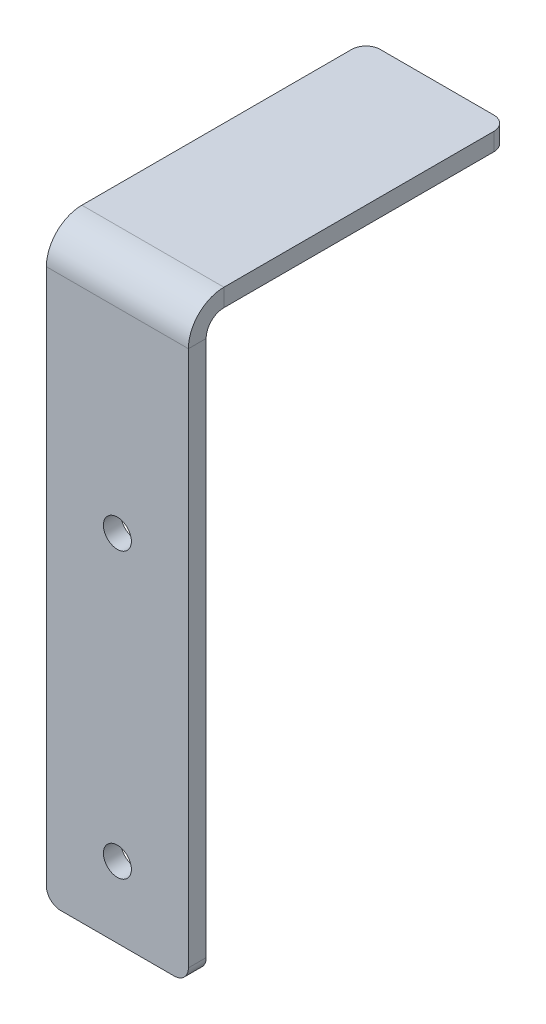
ISO-10303-21;
HEADER;
FILE_DESCRIPTION(('STEP AP214'),'2;1');
FILE_NAME('part.step','',(''),(''),'','','');
FILE_SCHEMA(('AUTOMOTIVE_DESIGN { 1 0 10303 214 1 1 1 1 }'));
ENDSEC;
DATA;
#1=APPLICATION_CONTEXT('core data for automotive mechanical design processes');
#2=APPLICATION_PROTOCOL_DEFINITION('international standard','automotive_design',2000,#1);
#3=PRODUCT_CONTEXT('',#1,'mechanical');
#4=PRODUCT('Part','Part','',(#3));
#5=PRODUCT_RELATED_PRODUCT_CATEGORY('part','',(#4));
#6=PRODUCT_DEFINITION_FORMATION('','',#4);
#7=PRODUCT_DEFINITION_CONTEXT('part definition',#1,'design');
#8=PRODUCT_DEFINITION('design','',#6,#7);
#9=PRODUCT_DEFINITION_SHAPE('','',#8);
#10=(LENGTH_UNIT() NAMED_UNIT(*) SI_UNIT(.MILLI.,.METRE.));
#11=(NAMED_UNIT(*) PLANE_ANGLE_UNIT() SI_UNIT($,.RADIAN.));
#12=(NAMED_UNIT(*) SI_UNIT($,.STERADIAN.) SOLID_ANGLE_UNIT());
#13=UNCERTAINTY_MEASURE_WITH_UNIT(LENGTH_MEASURE(1.E-05),#10,'distance_accuracy_value','');
#14=(GEOMETRIC_REPRESENTATION_CONTEXT(3) GLOBAL_UNCERTAINTY_ASSIGNED_CONTEXT((#13)) GLOBAL_UNIT_ASSIGNED_CONTEXT((#10,
#11,#12)) REPRESENTATION_CONTEXT('',''));
#15=CARTESIAN_POINT('',(0.,0.,0.));
#16=DIRECTION('',(0.,0.,1.));
#17=DIRECTION('',(1.,0.,0.));
#18=AXIS2_PLACEMENT_3D('',#15,#16,#17);
#19=CARTESIAN_POINT('',(11.6682781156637,27.7790891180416,-3.175));
#20=DIRECTION('',(1.,0.,0.));
#21=DIRECTION('',(0.,1.,0.));
#22=AXIS2_PLACEMENT_3D('',#19,#20,#21);
#23=PLANE('',#22);
#24=DIRECTION('',(0.,1.,0.));
#25=VECTOR('',#24,1.);
#26=CARTESIAN_POINT('',(11.6682781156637,27.7790891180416,0.));
#27=LINE('',#26,#25);
#28=CARTESIAN_POINT('',(11.6682781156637,-71.2809108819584,0.));
#29=VERTEX_POINT('',#28);
#30=CARTESIAN_POINT('',(11.6682781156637,24.6040891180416,0.));
#31=VERTEX_POINT('',#30);
#32=EDGE_CURVE('E185',#29,#31,#27,.T.);
#33=ORIENTED_EDGE('',*,*,#32,.F.);
#34=DIRECTION('',(0.,0.,1.));
#35=VECTOR('',#34,1.);
#36=CARTESIAN_POINT('',(11.6682781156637,-71.2809108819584,-3.175));
#37=LINE('',#36,#35);
#38=CARTESIAN_POINT('',(11.6682781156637,-71.2809108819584,-3.175));
#39=VERTEX_POINT('',#38);
#40=EDGE_CURVE('E212',#29,#39,#37,.F.);
#41=ORIENTED_EDGE('',*,*,#40,.T.);
#42=DIRECTION('',(0.,1.,0.));
#43=VECTOR('',#42,1.);
#44=CARTESIAN_POINT('',(11.6682781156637,27.7790891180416,-3.175));
#45=LINE('',#44,#43);
#46=CARTESIAN_POINT('',(11.6682781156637,24.6040891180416,-3.175));
#47=VERTEX_POINT('',#46);
#48=EDGE_CURVE('E188',#39,#47,#45,.T.);
#49=ORIENTED_EDGE('',*,*,#48,.T.);
#50=DIRECTION('',(0.,0.,1.));
#51=VECTOR('',#50,1.);
#52=CARTESIAN_POINT('',(11.6682781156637,24.6040891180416,-3.175));
#53=LINE('',#52,#51);
#54=EDGE_CURVE('E169',#47,#31,#53,.T.);
#55=ORIENTED_EDGE('',*,*,#54,.T.);
#56=EDGE_LOOP('',(#33,#41,#49,#55));
#57=FACE_BOUND('',#56,.T.);
#58=ADVANCED_FACE('F33',(#57),#23,.T.);
#59=CARTESIAN_POINT('',(-13.7317218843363,-73.8209108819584,-3.175));
#60=DIRECTION('',(0.,0.,1.));
#61=DIRECTION('',(1.,0.,0.));
#62=AXIS2_PLACEMENT_3D('',#59,#60,#61);
#63=PLANE('',#62);
#64=CARTESIAN_POINT('',(-1.03172188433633,-10.3209108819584,-3.175));
#65=DIRECTION('',(0.,0.,1.));
#66=DIRECTION('',(1.,0.,0.));
#67=AXIS2_PLACEMENT_3D('',#64,#65,#66);
#68=CIRCLE('',#67,2.5019);
#69=CARTESIAN_POINT('',(1.47017811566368,-10.3209108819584,-3.175));
#70=VERTEX_POINT('',#69);
#71=EDGE_CURVE('E252',#70,#70,#68,.T.);
#72=ORIENTED_EDGE('',*,*,#71,.T.);
#73=EDGE_LOOP('',(#72));
#74=FACE_BOUND('',#73,.T.);
#75=CARTESIAN_POINT('',(-1.03172188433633,-61.1209108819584,-3.175));
#76=DIRECTION('',(0.,0.,1.));
#77=DIRECTION('',(1.,0.,0.));
#78=AXIS2_PLACEMENT_3D('',#75,#76,#77);
#79=CIRCLE('',#78,2.5);
#80=CARTESIAN_POINT('',(1.46827811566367,-61.1209108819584,-3.175));
#81=VERTEX_POINT('',#80);
#82=EDGE_CURVE('E245',#81,#81,#79,.T.);
#83=ORIENTED_EDGE('',*,*,#82,.T.);
#84=EDGE_LOOP('',(#83));
#85=FACE_BOUND('',#84,.T.);
#86=DIRECTION('',(1.,0.,0.));
#87=VECTOR('',#86,1.);
#88=CARTESIAN_POINT('',(-13.7317218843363,-73.8209108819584,-3.175));
#89=LINE('',#88,#87);
#90=CARTESIAN_POINT('',(-11.1917218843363,-73.8209108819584,-3.175));
#91=VERTEX_POINT('',#90);
#92=CARTESIAN_POINT('',(9.12827811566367,-73.8209108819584,-3.175));
#93=VERTEX_POINT('',#92);
#94=EDGE_CURVE('E184',#91,#93,#89,.T.);
#95=ORIENTED_EDGE('',*,*,#94,.F.);
#96=CARTESIAN_POINT('',(-11.1917218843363,-71.2809108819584,-3.175));
#97=DIRECTION('',(0.,0.,1.));
#98=DIRECTION('',(1.,0.,0.));
#99=AXIS2_PLACEMENT_3D('',#96,#97,#98);
#100=CIRCLE('',#99,2.54);
#101=CARTESIAN_POINT('',(-13.7317218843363,-71.2809108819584,-3.175));
#102=VERTEX_POINT('',#101);
#103=EDGE_CURVE('E210',#91,#102,#100,.F.);
#104=ORIENTED_EDGE('',*,*,#103,.T.);
#105=DIRECTION('',(0.,-1.,0.));
#106=VECTOR('',#105,1.);
#107=CARTESIAN_POINT('',(-13.7317218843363,27.7790891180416,-3.175));
#108=LINE('',#107,#106);
#109=CARTESIAN_POINT('',(-13.7317218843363,24.6040891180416,-3.175));
#110=VERTEX_POINT('',#109);
#111=EDGE_CURVE('E181',#110,#102,#108,.T.);
#112=ORIENTED_EDGE('',*,*,#111,.F.);
#113=DIRECTION('',(1.,0.,0.));
#114=VECTOR('',#113,1.);
#115=CARTESIAN_POINT('',(11.6682781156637,24.6040891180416,-3.175));
#116=LINE('',#115,#114);
#117=EDGE_CURVE('E173',#47,#110,#116,.F.);
#118=ORIENTED_EDGE('',*,*,#117,.F.);
#119=ORIENTED_EDGE('',*,*,#48,.F.);
#120=CARTESIAN_POINT('',(9.12827811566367,-71.2809108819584,-3.175));
#121=DIRECTION('',(0.,0.,1.));
#122=DIRECTION('',(1.,0.,0.));
#123=AXIS2_PLACEMENT_3D('',#120,#121,#122);
#124=CIRCLE('',#123,2.54);
#125=EDGE_CURVE('E208',#39,#93,#124,.F.);
#126=ORIENTED_EDGE('',*,*,#125,.T.);
#127=EDGE_LOOP('',(#95,#104,#112,#118,#119,#126));
#128=FACE_BOUND('',#127,.T.);
#129=ADVANCED_FACE('F266',(#74,#85,#128),#63,.F.);
#130=CARTESIAN_POINT('',(-13.7317218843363,-73.8209108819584,0.));
#131=DIRECTION('',(0.,0.,1.));
#132=DIRECTION('',(1.,0.,0.));
#133=AXIS2_PLACEMENT_3D('',#130,#131,#132);
#134=PLANE('',#133);
#135=CARTESIAN_POINT('',(-1.03172188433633,-10.3209108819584,0.));
#136=DIRECTION('',(0.,0.,1.));
#137=DIRECTION('',(1.,0.,0.));
#138=AXIS2_PLACEMENT_3D('',#135,#136,#137);
#139=CIRCLE('',#138,2.5019);
#140=CARTESIAN_POINT('',(1.47017811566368,-10.3209108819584,0.));
#141=VERTEX_POINT('',#140);
#142=EDGE_CURVE('E255',#141,#141,#139,.T.);
#143=ORIENTED_EDGE('',*,*,#142,.F.);
#144=EDGE_LOOP('',(#143));
#145=FACE_BOUND('',#144,.T.);
#146=CARTESIAN_POINT('',(-1.03172188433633,-61.1209108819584,0.));
#147=DIRECTION('',(0.,0.,1.));
#148=DIRECTION('',(1.,0.,0.));
#149=AXIS2_PLACEMENT_3D('',#146,#147,#148);
#150=CIRCLE('',#149,2.5);
#151=CARTESIAN_POINT('',(1.46827811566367,-61.1209108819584,0.));
#152=VERTEX_POINT('',#151);
#153=EDGE_CURVE('E249',#152,#152,#150,.T.);
#154=ORIENTED_EDGE('',*,*,#153,.F.);
#155=EDGE_LOOP('',(#154));
#156=FACE_BOUND('',#155,.T.);
#157=DIRECTION('',(0.,-1.,0.));
#158=VECTOR('',#157,1.);
#159=CARTESIAN_POINT('',(-13.7317218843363,27.7790891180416,0.));
#160=LINE('',#159,#158);
#161=CARTESIAN_POINT('',(-13.7317218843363,24.6040891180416,0.));
#162=VERTEX_POINT('',#161);
#163=CARTESIAN_POINT('',(-13.7317218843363,-71.2809108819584,0.));
#164=VERTEX_POINT('',#163);
#165=EDGE_CURVE('E179',#162,#164,#160,.T.);
#166=ORIENTED_EDGE('',*,*,#165,.T.);
#167=CARTESIAN_POINT('',(-11.1917218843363,-71.2809108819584,0.));
#168=DIRECTION('',(0.,0.,1.));
#169=DIRECTION('',(1.,0.,0.));
#170=AXIS2_PLACEMENT_3D('',#167,#168,#169);
#171=CIRCLE('',#170,2.54);
#172=CARTESIAN_POINT('',(-11.1917218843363,-73.8209108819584,0.));
#173=VERTEX_POINT('',#172);
#174=EDGE_CURVE('E201',#164,#173,#171,.T.);
#175=ORIENTED_EDGE('',*,*,#174,.T.);
#176=DIRECTION('',(1.,0.,0.));
#177=VECTOR('',#176,1.);
#178=CARTESIAN_POINT('',(-13.7317218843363,-73.8209108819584,0.));
#179=LINE('',#178,#177);
#180=CARTESIAN_POINT('',(9.12827811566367,-73.8209108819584,0.));
#181=VERTEX_POINT('',#180);
#182=EDGE_CURVE('E193',#173,#181,#179,.T.);
#183=ORIENTED_EDGE('',*,*,#182,.T.);
#184=CARTESIAN_POINT('',(9.12827811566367,-71.2809108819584,0.));
#185=DIRECTION('',(0.,0.,1.));
#186=DIRECTION('',(1.,0.,0.));
#187=AXIS2_PLACEMENT_3D('',#184,#185,#186);
#188=CIRCLE('',#187,2.54);
#189=EDGE_CURVE('E199',#181,#29,#188,.T.);
#190=ORIENTED_EDGE('',*,*,#189,.T.);
#191=ORIENTED_EDGE('',*,*,#32,.T.);
#192=DIRECTION('',(1.,0.,0.));
#193=VECTOR('',#192,1.);
#194=CARTESIAN_POINT('',(11.6682781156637,24.6040891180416,0.));
#195=LINE('',#194,#193);
#196=EDGE_CURVE('E132',#31,#162,#195,.F.);
#197=ORIENTED_EDGE('',*,*,#196,.T.);
#198=EDGE_LOOP('',(#166,#175,#183,#190,#191,#197));
#199=FACE_BOUND('',#198,.T.);
#200=ADVANCED_FACE('F262',(#145,#156,#199),#134,.T.);
#201=CARTESIAN_POINT('',(-13.7317218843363,27.7790891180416,-3.175));
#202=DIRECTION('',(-1.,0.,0.));
#203=DIRECTION('',(0.,-1.,0.));
#204=AXIS2_PLACEMENT_3D('',#201,#202,#203);
#205=PLANE('',#204);
#206=ORIENTED_EDGE('',*,*,#111,.T.);
#207=DIRECTION('',(0.,0.,1.));
#208=VECTOR('',#207,1.);
#209=CARTESIAN_POINT('',(-13.7317218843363,-71.2809108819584,-3.175));
#210=LINE('',#209,#208);
#211=EDGE_CURVE('E190',#102,#164,#210,.T.);
#212=ORIENTED_EDGE('',*,*,#211,.T.);
#213=ORIENTED_EDGE('',*,*,#165,.F.);
#214=DIRECTION('',(0.,0.,1.));
#215=VECTOR('',#214,1.);
#216=CARTESIAN_POINT('',(-13.7317218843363,24.6040891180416,-3.175));
#217=LINE('',#216,#215);
#218=EDGE_CURVE('E176',#110,#162,#217,.T.);
#219=ORIENTED_EDGE('',*,*,#218,.F.);
#220=EDGE_LOOP('',(#206,#212,#213,#219));
#221=FACE_BOUND('',#220,.T.);
#222=ADVANCED_FACE('F265',(#221),#205,.T.);
#223=CARTESIAN_POINT('',(-13.7317218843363,-73.8209108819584,-3.175));
#224=DIRECTION('',(0.,-1.,0.));
#225=DIRECTION('',(0.,0.,-1.));
#226=AXIS2_PLACEMENT_3D('',#223,#224,#225);
#227=PLANE('',#226);
#228=ORIENTED_EDGE('',*,*,#182,.F.);
#229=DIRECTION('',(0.,0.,1.));
#230=VECTOR('',#229,1.);
#231=CARTESIAN_POINT('',(-11.1917218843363,-73.8209108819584,-3.175));
#232=LINE('',#231,#230);
#233=EDGE_CURVE('E206',#173,#91,#232,.F.);
#234=ORIENTED_EDGE('',*,*,#233,.T.);
#235=ORIENTED_EDGE('',*,*,#94,.T.);
#236=DIRECTION('',(0.,0.,1.));
#237=VECTOR('',#236,1.);
#238=CARTESIAN_POINT('',(9.12827811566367,-73.8209108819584,-3.175));
#239=LINE('',#238,#237);
#240=EDGE_CURVE('E203',#93,#181,#239,.T.);
#241=ORIENTED_EDGE('',*,*,#240,.T.);
#242=EDGE_LOOP('',(#228,#234,#235,#241));
#243=FACE_BOUND('',#242,.T.);
#244=ADVANCED_FACE('F282',(#243),#227,.T.);
#245=CARTESIAN_POINT('',(-13.7317218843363,24.6040891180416,-6.35));
#246=DIRECTION('',(-1.,0.,0.));
#247=DIRECTION('',(0.,0.,1.));
#248=AXIS2_PLACEMENT_3D('',#245,#246,#247);
#249=PLANE('',#248);
#250=DIRECTION('',(0.,1.,0.));
#251=VECTOR('',#250,1.);
#252=CARTESIAN_POINT('',(-13.7317218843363,27.7790891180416,-6.34999999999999));
#253=LINE('',#252,#251);
#254=CARTESIAN_POINT('',(-13.7317218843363,27.7790891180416,-6.34999999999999));
#255=VERTEX_POINT('',#254);
#256=CARTESIAN_POINT('',(-13.7317218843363,30.9540891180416,-6.34999999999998));
#257=VERTEX_POINT('',#256);
#258=EDGE_CURVE('E234',#255,#257,#253,.T.);
#259=ORIENTED_EDGE('',*,*,#258,.F.);
#260=CARTESIAN_POINT('',(-13.7317218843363,24.6040891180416,-6.35));
#261=DIRECTION('',(1.,0.,0.));
#262=DIRECTION('',(0.,0.,-1.));
#263=AXIS2_PLACEMENT_3D('',#260,#261,#262);
#264=CIRCLE('',#263,3.175);
#265=EDGE_CURVE('E136',#110,#255,#264,.F.);
#266=ORIENTED_EDGE('',*,*,#265,.F.);
#267=ORIENTED_EDGE('',*,*,#218,.T.);
#268=CARTESIAN_POINT('',(-13.7317218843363,24.6040891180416,-6.35));
#269=DIRECTION('',(1.,0.,0.));
#270=DIRECTION('',(0.,0.,-1.));
#271=AXIS2_PLACEMENT_3D('',#268,#269,#270);
#272=CIRCLE('',#271,6.35);
#273=EDGE_CURVE('E168',#162,#257,#272,.F.);
#274=ORIENTED_EDGE('',*,*,#273,.T.);
#275=EDGE_LOOP('',(#259,#266,#267,#274));
#276=FACE_BOUND('',#275,.T.);
#277=ADVANCED_FACE('F296',(#276),#249,.T.);
#278=CARTESIAN_POINT('',(11.6682781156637,24.6040891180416,-6.35));
#279=DIRECTION('',(-1.,0.,0.));
#280=DIRECTION('',(0.,0.,1.));
#281=AXIS2_PLACEMENT_3D('',#278,#279,#280);
#282=PLANE('',#281);
#283=CARTESIAN_POINT('',(11.6682781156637,24.6040891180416,-6.35));
#284=DIRECTION('',(1.,0.,0.));
#285=DIRECTION('',(0.,0.,-1.));
#286=AXIS2_PLACEMENT_3D('',#283,#284,#285);
#287=CIRCLE('',#286,3.175);
#288=CARTESIAN_POINT('',(11.6682781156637,27.7790891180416,-6.34999999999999));
#289=VERTEX_POINT('',#288);
#290=EDGE_CURVE('E143',#289,#47,#287,.T.);
#291=ORIENTED_EDGE('',*,*,#290,.F.);
#292=DIRECTION('',(0.,1.,0.));
#293=VECTOR('',#292,1.);
#294=CARTESIAN_POINT('',(11.6682781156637,27.7790891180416,-6.34999999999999));
#295=LINE('',#294,#293);
#296=CARTESIAN_POINT('',(11.6682781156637,30.9540891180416,-6.34999999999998));
#297=VERTEX_POINT('',#296);
#298=EDGE_CURVE('E140',#289,#297,#295,.T.);
#299=ORIENTED_EDGE('',*,*,#298,.T.);
#300=CARTESIAN_POINT('',(11.6682781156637,24.6040891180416,-6.35));
#301=DIRECTION('',(1.,0.,0.));
#302=DIRECTION('',(0.,0.,-1.));
#303=AXIS2_PLACEMENT_3D('',#300,#301,#302);
#304=CIRCLE('',#303,6.35);
#305=EDGE_CURVE('E125',#297,#31,#304,.T.);
#306=ORIENTED_EDGE('',*,*,#305,.T.);
#307=ORIENTED_EDGE('',*,*,#54,.F.);
#308=EDGE_LOOP('',(#291,#299,#306,#307));
#309=FACE_BOUND('',#308,.T.);
#310=ADVANCED_FACE('F141',(#309),#282,.F.);
#311=CARTESIAN_POINT('',(11.6682781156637,24.6040891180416,-6.35));
#312=DIRECTION('',(1.,0.,0.));
#313=DIRECTION('',(0.,1.,0.));
#314=AXIS2_PLACEMENT_3D('',#311,#312,#313);
#315=CYLINDRICAL_SURFACE('',#314,6.35);
#316=ORIENTED_EDGE('',*,*,#196,.F.);
#317=ORIENTED_EDGE('',*,*,#305,.F.);
#318=DIRECTION('',(-1.,0.,0.));
#319=VECTOR('',#318,1.);
#320=CARTESIAN_POINT('',(11.6682781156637,30.9540891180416,-6.34999999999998));
#321=LINE('',#320,#319);
#322=EDGE_CURVE('E129',#297,#257,#321,.T.);
#323=ORIENTED_EDGE('',*,*,#322,.T.);
#324=ORIENTED_EDGE('',*,*,#273,.F.);
#325=EDGE_LOOP('',(#316,#317,#323,#324));
#326=FACE_BOUND('',#325,.T.);
#327=ADVANCED_FACE('F127',(#326),#315,.T.);
#328=CARTESIAN_POINT('',(11.6682781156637,24.6040891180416,-6.35));
#329=DIRECTION('',(1.,0.,0.));
#330=DIRECTION('',(0.,1.,0.));
#331=AXIS2_PLACEMENT_3D('',#328,#329,#330);
#332=CYLINDRICAL_SURFACE('',#331,3.175);
#333=ORIENTED_EDGE('',*,*,#117,.T.);
#334=ORIENTED_EDGE('',*,*,#265,.T.);
#335=DIRECTION('',(1.,0.,0.));
#336=VECTOR('',#335,1.);
#337=CARTESIAN_POINT('',(-13.7317218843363,27.7790891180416,-6.34999999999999));
#338=LINE('',#337,#336);
#339=EDGE_CURVE('E145',#255,#289,#338,.T.);
#340=ORIENTED_EDGE('',*,*,#339,.T.);
#341=ORIENTED_EDGE('',*,*,#290,.T.);
#342=EDGE_LOOP('',(#333,#334,#340,#341));
#343=FACE_BOUND('',#342,.T.);
#344=ADVANCED_FACE('F293',(#343),#332,.F.);
#345=CARTESIAN_POINT('',(11.6682781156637,30.9540891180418,-57.15));
#346=DIRECTION('',(-1.,0.,0.));
#347=DIRECTION('',(0.,0.,1.));
#348=AXIS2_PLACEMENT_3D('',#345,#346,#347);
#349=PLANE('',#348);
#350=DIRECTION('',(0.,0.,-1.));
#351=VECTOR('',#350,1.);
#352=CARTESIAN_POINT('',(11.6682781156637,27.7790891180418,-57.15));
#353=LINE('',#352,#351);
#354=CARTESIAN_POINT('',(11.6682781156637,27.7790891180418,-54.61));
#355=VERTEX_POINT('',#354);
#356=EDGE_CURVE('E153',#289,#355,#353,.T.);
#357=ORIENTED_EDGE('',*,*,#356,.T.);
#358=DIRECTION('',(0.,-1.,0.));
#359=VECTOR('',#358,1.);
#360=CARTESIAN_POINT('',(11.6682781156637,30.9540891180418,-54.61));
#361=LINE('',#360,#359);
#362=CARTESIAN_POINT('',(11.6682781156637,30.9540891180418,-54.61));
#363=VERTEX_POINT('',#362);
#364=EDGE_CURVE('E11',#355,#363,#361,.F.);
#365=ORIENTED_EDGE('',*,*,#364,.T.);
#366=DIRECTION('',(0.,0.,-1.));
#367=VECTOR('',#366,1.);
#368=CARTESIAN_POINT('',(11.6682781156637,30.9540891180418,-57.15));
#369=LINE('',#368,#367);
#370=EDGE_CURVE('E149',#297,#363,#369,.T.);
#371=ORIENTED_EDGE('',*,*,#370,.F.);
#372=ORIENTED_EDGE('',*,*,#298,.F.);
#373=EDGE_LOOP('',(#357,#365,#371,#372));
#374=FACE_BOUND('',#373,.T.);
#375=ADVANCED_FACE('F155',(#374),#349,.F.);
#376=CARTESIAN_POINT('',(-13.7317218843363,30.9540891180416,-3.17499999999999));
#377=DIRECTION('',(1.,0.,0.));
#378=DIRECTION('',(0.,0.,-1.));
#379=AXIS2_PLACEMENT_3D('',#376,#377,#378);
#380=PLANE('',#379);
#381=DIRECTION('',(0.,0.,1.));
#382=VECTOR('',#381,1.);
#383=CARTESIAN_POINT('',(-13.7317218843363,30.9540891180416,-3.17499999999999));
#384=LINE('',#383,#382);
#385=CARTESIAN_POINT('',(-13.7317218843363,30.9540891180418,-54.61));
#386=VERTEX_POINT('',#385);
#387=EDGE_CURVE('E152',#386,#257,#384,.T.);
#388=ORIENTED_EDGE('',*,*,#387,.F.);
#389=DIRECTION('',(0.,-1.,0.));
#390=VECTOR('',#389,1.);
#391=CARTESIAN_POINT('',(-13.7317218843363,30.9540891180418,-54.61));
#392=LINE('',#391,#390);
#393=CARTESIAN_POINT('',(-13.7317218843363,27.7790891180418,-54.61));
#394=VERTEX_POINT('',#393);
#395=EDGE_CURVE('E214',#386,#394,#392,.T.);
#396=ORIENTED_EDGE('',*,*,#395,.T.);
#397=DIRECTION('',(0.,0.,1.));
#398=VECTOR('',#397,1.);
#399=CARTESIAN_POINT('',(-13.7317218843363,27.7790891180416,-3.175));
#400=LINE('',#399,#398);
#401=EDGE_CURVE('E157',#394,#255,#400,.T.);
#402=ORIENTED_EDGE('',*,*,#401,.T.);
#403=ORIENTED_EDGE('',*,*,#258,.T.);
#404=EDGE_LOOP('',(#388,#396,#402,#403));
#405=FACE_BOUND('',#404,.T.);
#406=ADVANCED_FACE('F231',(#405),#380,.F.);
#407=CARTESIAN_POINT('',(11.6682781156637,30.9540891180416,-3.17499999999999));
#408=DIRECTION('',(0.,-1.,0.));
#409=DIRECTION('',(0.,0.,-1.));
#410=AXIS2_PLACEMENT_3D('',#407,#408,#409);
#411=PLANE('',#410);
#412=DIRECTION('',(-1.,0.,0.));
#413=VECTOR('',#412,1.);
#414=CARTESIAN_POINT('',(-13.7317218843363,30.9540891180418,-57.15));
#415=LINE('',#414,#413);
#416=CARTESIAN_POINT('',(9.12827811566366,30.9540891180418,-57.15));
#417=VERTEX_POINT('',#416);
#418=CARTESIAN_POINT('',(-11.1917218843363,30.9540891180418,-57.15));
#419=VERTEX_POINT('',#418);
#420=EDGE_CURVE('E156',#417,#419,#415,.T.);
#421=ORIENTED_EDGE('',*,*,#420,.T.);
#422=CARTESIAN_POINT('',(-11.1917218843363,30.9540891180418,-54.61));
#423=DIRECTION('',(0.,-1.,0.));
#424=DIRECTION('',(0.,0.,-1.));
#425=AXIS2_PLACEMENT_3D('',#422,#423,#424);
#426=CIRCLE('',#425,2.54);
#427=EDGE_CURVE('E41',#419,#386,#426,.F.);
#428=ORIENTED_EDGE('',*,*,#427,.T.);
#429=ORIENTED_EDGE('',*,*,#387,.T.);
#430=ORIENTED_EDGE('',*,*,#322,.F.);
#431=ORIENTED_EDGE('',*,*,#370,.T.);
#432=CARTESIAN_POINT('',(9.12827811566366,30.9540891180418,-54.61));
#433=DIRECTION('',(0.,-1.,0.));
#434=DIRECTION('',(0.,0.,-1.));
#435=AXIS2_PLACEMENT_3D('',#432,#433,#434);
#436=CIRCLE('',#435,2.54);
#437=EDGE_CURVE('E225',#363,#417,#436,.F.);
#438=ORIENTED_EDGE('',*,*,#437,.T.);
#439=EDGE_LOOP('',(#421,#428,#429,#430,#431,#438));
#440=FACE_BOUND('',#439,.T.);
#441=ADVANCED_FACE('F148',(#440),#411,.F.);
#442=CARTESIAN_POINT('',(11.6682781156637,27.7790891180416,-3.175));
#443=DIRECTION('',(0.,-1.,0.));
#444=DIRECTION('',(0.,0.,-1.));
#445=AXIS2_PLACEMENT_3D('',#442,#443,#444);
#446=PLANE('',#445);
#447=ORIENTED_EDGE('',*,*,#401,.F.);
#448=CARTESIAN_POINT('',(-11.1917218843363,27.7790891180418,-54.61));
#449=DIRECTION('',(0.,-1.,0.));
#450=DIRECTION('',(0.,0.,-1.));
#451=AXIS2_PLACEMENT_3D('',#448,#449,#450);
#452=CIRCLE('',#451,2.54);
#453=CARTESIAN_POINT('',(-11.1917218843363,27.7790891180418,-57.15));
#454=VERTEX_POINT('',#453);
#455=EDGE_CURVE('E219',#394,#454,#452,.T.);
#456=ORIENTED_EDGE('',*,*,#455,.T.);
#457=DIRECTION('',(-1.,0.,0.));
#458=VECTOR('',#457,1.);
#459=CARTESIAN_POINT('',(-13.7317218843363,27.7790891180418,-57.15));
#460=LINE('',#459,#458);
#461=CARTESIAN_POINT('',(9.12827811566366,27.7790891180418,-57.15));
#462=VERTEX_POINT('',#461);
#463=EDGE_CURVE('E160',#462,#454,#460,.T.);
#464=ORIENTED_EDGE('',*,*,#463,.F.);
#465=CARTESIAN_POINT('',(9.12827811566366,27.7790891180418,-54.61));
#466=DIRECTION('',(0.,-1.,0.));
#467=DIRECTION('',(0.,0.,-1.));
#468=AXIS2_PLACEMENT_3D('',#465,#466,#467);
#469=CIRCLE('',#468,2.54);
#470=EDGE_CURVE('E217',#462,#355,#469,.T.);
#471=ORIENTED_EDGE('',*,*,#470,.T.);
#472=ORIENTED_EDGE('',*,*,#356,.F.);
#473=ORIENTED_EDGE('',*,*,#339,.F.);
#474=EDGE_LOOP('',(#447,#456,#464,#471,#472,#473));
#475=FACE_BOUND('',#474,.T.);
#476=ADVANCED_FACE('F238',(#475),#446,.T.);
#477=CARTESIAN_POINT('',(-13.7317218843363,30.9540891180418,-57.15));
#478=DIRECTION('',(0.,0.,1.));
#479=DIRECTION('',(0.,-1.,0.));
#480=AXIS2_PLACEMENT_3D('',#477,#478,#479);
#481=PLANE('',#480);
#482=ORIENTED_EDGE('',*,*,#463,.T.);
#483=DIRECTION('',(0.,-1.,0.));
#484=VECTOR('',#483,1.);
#485=CARTESIAN_POINT('',(-11.1917218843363,30.9540891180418,-57.15));
#486=LINE('',#485,#484);
#487=EDGE_CURVE('E54',#454,#419,#486,.F.);
#488=ORIENTED_EDGE('',*,*,#487,.T.);
#489=ORIENTED_EDGE('',*,*,#420,.F.);
#490=DIRECTION('',(0.,-1.,0.));
#491=VECTOR('',#490,1.);
#492=CARTESIAN_POINT('',(9.12827811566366,30.9540891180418,-57.15));
#493=LINE('',#492,#491);
#494=EDGE_CURVE('E221',#417,#462,#493,.T.);
#495=ORIENTED_EDGE('',*,*,#494,.T.);
#496=EDGE_LOOP('',(#482,#488,#489,#495));
#497=FACE_BOUND('',#496,.T.);
#498=ADVANCED_FACE('F240',(#497),#481,.F.);
#499=CARTESIAN_POINT('',(-1.03172188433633,-61.1209108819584,-57.15));
#500=DIRECTION('',(0.,0.,1.));
#501=DIRECTION('',(1.,0.,0.));
#502=AXIS2_PLACEMENT_3D('',#499,#500,#501);
#503=CYLINDRICAL_SURFACE('',#502,2.5);
#504=CARTESIAN_POINT('',(1.46827811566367,-61.1209108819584,0.));
#505=CARTESIAN_POINT('',(1.46827811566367,-61.1209108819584,-0.0330729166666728));
#506=CARTESIAN_POINT('',(1.46827811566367,-61.1209108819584,-0.0661458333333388));
#507=CARTESIAN_POINT('',(1.46827811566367,-61.1209108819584,-0.132291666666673));
#508=CARTESIAN_POINT('',(1.46827811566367,-61.1209108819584,-0.165364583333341));
#509=CARTESIAN_POINT('',(1.46827811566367,-61.1209108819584,-0.231510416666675));
#510=CARTESIAN_POINT('',(1.46827811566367,-61.1209108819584,-0.264583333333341));
#511=CARTESIAN_POINT('',(1.46827811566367,-61.1209108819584,-0.330729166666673));
#512=CARTESIAN_POINT('',(1.46827811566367,-61.1209108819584,-0.363802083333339));
#513=CARTESIAN_POINT('',(1.46827811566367,-61.1209108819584,-0.429947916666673));
#514=CARTESIAN_POINT('',(1.46827811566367,-61.1209108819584,-0.463020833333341));
#515=CARTESIAN_POINT('',(1.46827811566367,-61.1209108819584,-0.529166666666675));
#516=CARTESIAN_POINT('',(1.46827811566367,-61.1209108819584,-0.562239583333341));
#517=CARTESIAN_POINT('',(1.46827811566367,-61.1209108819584,-0.628385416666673));
#518=CARTESIAN_POINT('',(1.46827811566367,-61.1209108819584,-0.661458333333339));
#519=CARTESIAN_POINT('',(1.46827811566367,-61.1209108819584,-0.727604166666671));
#520=CARTESIAN_POINT('',(1.46827811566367,-61.1209108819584,-0.760677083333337));
#521=CARTESIAN_POINT('',(1.46827811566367,-61.1209108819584,-0.826822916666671));
#522=CARTESIAN_POINT('',(1.46827811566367,-61.1209108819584,-0.859895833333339));
#523=CARTESIAN_POINT('',(1.46827811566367,-61.1209108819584,-0.926041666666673));
#524=CARTESIAN_POINT('',(1.46827811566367,-61.1209108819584,-0.959114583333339));
#525=CARTESIAN_POINT('',(1.46827811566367,-61.1209108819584,-1.02526041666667));
#526=CARTESIAN_POINT('',(1.46827811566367,-61.1209108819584,-1.05833333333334));
#527=CARTESIAN_POINT('',(1.46827811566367,-61.1209108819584,-1.12447916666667));
#528=CARTESIAN_POINT('',(1.46827811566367,-61.1209108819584,-1.15755208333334));
#529=CARTESIAN_POINT('',(1.46827811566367,-61.1209108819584,-1.22369791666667));
#530=CARTESIAN_POINT('',(1.46827811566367,-61.1209108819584,-1.25677083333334));
#531=CARTESIAN_POINT('',(1.46827811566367,-61.1209108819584,-1.32291666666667));
#532=CARTESIAN_POINT('',(1.46827811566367,-61.1209108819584,-1.35598958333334));
#533=CARTESIAN_POINT('',(1.46827811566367,-61.1209108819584,-1.42213541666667));
#534=CARTESIAN_POINT('',(1.46827811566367,-61.1209108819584,-1.45520833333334));
#535=CARTESIAN_POINT('',(1.46827811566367,-61.1209108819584,-1.52135416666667));
#536=CARTESIAN_POINT('',(1.46827811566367,-61.1209108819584,-1.55442708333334));
#537=CARTESIAN_POINT('',(1.46827811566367,-61.1209108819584,-1.62057291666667));
#538=CARTESIAN_POINT('',(1.46827811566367,-61.1209108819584,-1.65364583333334));
#539=CARTESIAN_POINT('',(1.46827811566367,-61.1209108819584,-1.71979166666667));
#540=CARTESIAN_POINT('',(1.46827811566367,-61.1209108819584,-1.75286458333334));
#541=CARTESIAN_POINT('',(1.46827811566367,-61.1209108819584,-1.81901041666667));
#542=CARTESIAN_POINT('',(1.46827811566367,-61.1209108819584,-1.85208333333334));
#543=CARTESIAN_POINT('',(1.46827811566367,-61.1209108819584,-1.91822916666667));
#544=CARTESIAN_POINT('',(1.46827811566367,-61.1209108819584,-1.95130208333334));
#545=CARTESIAN_POINT('',(1.46827811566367,-61.1209108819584,-2.01744791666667));
#546=CARTESIAN_POINT('',(1.46827811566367,-61.1209108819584,-2.05052083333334));
#547=CARTESIAN_POINT('',(1.46827811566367,-61.1209108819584,-2.11666666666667));
#548=CARTESIAN_POINT('',(1.46827811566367,-61.1209108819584,-2.14973958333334));
#549=CARTESIAN_POINT('',(1.46827811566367,-61.1209108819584,-2.21588541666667));
#550=CARTESIAN_POINT('',(1.46827811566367,-61.1209108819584,-2.24895833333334));
#551=CARTESIAN_POINT('',(1.46827811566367,-61.1209108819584,-2.31510416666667));
#552=CARTESIAN_POINT('',(1.46827811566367,-61.1209108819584,-2.34817708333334));
#553=CARTESIAN_POINT('',(1.46827811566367,-61.1209108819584,-2.41432291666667));
#554=CARTESIAN_POINT('',(1.46827811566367,-61.1209108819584,-2.44739583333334));
#555=CARTESIAN_POINT('',(1.46827811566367,-61.1209108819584,-2.51354166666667));
#556=CARTESIAN_POINT('',(1.46827811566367,-61.1209108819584,-2.54661458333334));
#557=CARTESIAN_POINT('',(1.46827811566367,-61.1209108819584,-2.61276041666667));
#558=CARTESIAN_POINT('',(1.46827811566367,-61.1209108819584,-2.64583333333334));
#559=CARTESIAN_POINT('',(1.46827811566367,-61.1209108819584,-2.71197916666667));
#560=CARTESIAN_POINT('',(1.46827811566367,-61.1209108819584,-2.74505208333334));
#561=CARTESIAN_POINT('',(1.46827811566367,-61.1209108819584,-2.81119791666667));
#562=CARTESIAN_POINT('',(1.46827811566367,-61.1209108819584,-2.84427083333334));
#563=CARTESIAN_POINT('',(1.46827811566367,-61.1209108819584,-2.91041666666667));
#564=CARTESIAN_POINT('',(1.46827811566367,-61.1209108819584,-2.94348958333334));
#565=CARTESIAN_POINT('',(1.46827811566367,-61.1209108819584,-3.00963541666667));
#566=CARTESIAN_POINT('',(1.46827811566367,-61.1209108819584,-3.04270833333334));
#567=CARTESIAN_POINT('',(1.46827811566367,-61.1209108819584,-3.10885416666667));
#568=CARTESIAN_POINT('',(1.46827811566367,-61.1209108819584,-3.14192708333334));
#569=CARTESIAN_POINT('',(1.46827811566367,-61.1209108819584,-3.175));
#570=B_SPLINE_CURVE_WITH_KNOTS('',3,(#504,#505,#506,#507,#508,#509,#510,#511,#512,#513,#514,
#515,#516,#517,#518,#519,#520,#521,#522,#523,#524,#525,#526,#527,#528,#529,#530,#531,#532,#533,
#534,#535,#536,#537,#538,#539,#540,#541,#542,#543,#544,#545,#546,#547,#548,#549,#550,#551,#552,
#553,#554,#555,#556,#557,#558,#559,#560,#561,#562,#563,#564,#565,#566,#567,#568,#569),
.UNSPECIFIED.,.F.,.F.,(4,2,2,2,2,2,2,2,2,2,2,2,2,2,2,2,2,2,2,2,2,2,2,2,2,2,2,2,2,2,2,2,4),(0.,
0.0992187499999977,0.198437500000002,0.29765625,0.396874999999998,0.496093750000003,0.5953125,
0.694531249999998,0.793749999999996,0.892968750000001,0.992187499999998,1.09140625,1.190625,
1.28984375,1.3890625,1.48828125,1.5875,1.68671875,1.7859375,1.88515625,1.984375,2.08359375,
2.1828125,2.28203125,2.38125,2.48046875,2.5796875,2.67890624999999,2.778125,2.87734375,
2.97656249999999,3.07578125,3.175),.UNSPECIFIED.);
#571=EDGE_CURVE('BSEAM354',#152,#81,#570,.T.);
#572=ORIENTED_EDGE('',*,*,#153,.T.);
#573=ORIENTED_EDGE('',*,*,#82,.F.);
#574=ORIENTED_EDGE('',*,*,#571,.T.);
#575=ORIENTED_EDGE('',*,*,#571,.F.);
#576=EDGE_LOOP('',(#572,#574,#573,#575));
#577=FACE_BOUND('',#576,.T.);
#578=ADVANCED_FACE('F354',(#577),#503,.F.);
#579=CARTESIAN_POINT('',(-1.03172188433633,-10.3209108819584,-57.15));
#580=DIRECTION('',(0.,0.,1.));
#581=DIRECTION('',(1.,0.,0.));
#582=AXIS2_PLACEMENT_3D('',#579,#580,#581);
#583=CYLINDRICAL_SURFACE('',#582,2.5019);
#584=CARTESIAN_POINT('',(1.47017811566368,-10.3209108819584,0.));
#585=CARTESIAN_POINT('',(1.47017811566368,-10.3209108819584,-0.0330729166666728));
#586=CARTESIAN_POINT('',(1.47017811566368,-10.3209108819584,-0.0661458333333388));
#587=CARTESIAN_POINT('',(1.47017811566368,-10.3209108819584,-0.132291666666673));
#588=CARTESIAN_POINT('',(1.47017811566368,-10.3209108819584,-0.165364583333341));
#589=CARTESIAN_POINT('',(1.47017811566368,-10.3209108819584,-0.231510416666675));
#590=CARTESIAN_POINT('',(1.47017811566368,-10.3209108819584,-0.264583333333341));
#591=CARTESIAN_POINT('',(1.47017811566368,-10.3209108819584,-0.330729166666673));
#592=CARTESIAN_POINT('',(1.47017811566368,-10.3209108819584,-0.363802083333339));
#593=CARTESIAN_POINT('',(1.47017811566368,-10.3209108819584,-0.429947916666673));
#594=CARTESIAN_POINT('',(1.47017811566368,-10.3209108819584,-0.463020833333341));
#595=CARTESIAN_POINT('',(1.47017811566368,-10.3209108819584,-0.529166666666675));
#596=CARTESIAN_POINT('',(1.47017811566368,-10.3209108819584,-0.562239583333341));
#597=CARTESIAN_POINT('',(1.47017811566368,-10.3209108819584,-0.628385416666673));
#598=CARTESIAN_POINT('',(1.47017811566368,-10.3209108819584,-0.661458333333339));
#599=CARTESIAN_POINT('',(1.47017811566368,-10.3209108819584,-0.727604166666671));
#600=CARTESIAN_POINT('',(1.47017811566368,-10.3209108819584,-0.760677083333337));
#601=CARTESIAN_POINT('',(1.47017811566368,-10.3209108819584,-0.826822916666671));
#602=CARTESIAN_POINT('',(1.47017811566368,-10.3209108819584,-0.859895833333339));
#603=CARTESIAN_POINT('',(1.47017811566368,-10.3209108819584,-0.926041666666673));
#604=CARTESIAN_POINT('',(1.47017811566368,-10.3209108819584,-0.959114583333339));
#605=CARTESIAN_POINT('',(1.47017811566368,-10.3209108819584,-1.02526041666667));
#606=CARTESIAN_POINT('',(1.47017811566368,-10.3209108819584,-1.05833333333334));
#607=CARTESIAN_POINT('',(1.47017811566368,-10.3209108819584,-1.12447916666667));
#608=CARTESIAN_POINT('',(1.47017811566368,-10.3209108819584,-1.15755208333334));
#609=CARTESIAN_POINT('',(1.47017811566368,-10.3209108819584,-1.22369791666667));
#610=CARTESIAN_POINT('',(1.47017811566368,-10.3209108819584,-1.25677083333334));
#611=CARTESIAN_POINT('',(1.47017811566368,-10.3209108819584,-1.32291666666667));
#612=CARTESIAN_POINT('',(1.47017811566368,-10.3209108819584,-1.35598958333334));
#613=CARTESIAN_POINT('',(1.47017811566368,-10.3209108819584,-1.42213541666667));
#614=CARTESIAN_POINT('',(1.47017811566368,-10.3209108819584,-1.45520833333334));
#615=CARTESIAN_POINT('',(1.47017811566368,-10.3209108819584,-1.52135416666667));
#616=CARTESIAN_POINT('',(1.47017811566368,-10.3209108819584,-1.55442708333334));
#617=CARTESIAN_POINT('',(1.47017811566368,-10.3209108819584,-1.62057291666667));
#618=CARTESIAN_POINT('',(1.47017811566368,-10.3209108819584,-1.65364583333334));
#619=CARTESIAN_POINT('',(1.47017811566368,-10.3209108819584,-1.71979166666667));
#620=CARTESIAN_POINT('',(1.47017811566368,-10.3209108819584,-1.75286458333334));
#621=CARTESIAN_POINT('',(1.47017811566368,-10.3209108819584,-1.81901041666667));
#622=CARTESIAN_POINT('',(1.47017811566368,-10.3209108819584,-1.85208333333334));
#623=CARTESIAN_POINT('',(1.47017811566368,-10.3209108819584,-1.91822916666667));
#624=CARTESIAN_POINT('',(1.47017811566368,-10.3209108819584,-1.95130208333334));
#625=CARTESIAN_POINT('',(1.47017811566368,-10.3209108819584,-2.01744791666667));
#626=CARTESIAN_POINT('',(1.47017811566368,-10.3209108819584,-2.05052083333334));
#627=CARTESIAN_POINT('',(1.47017811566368,-10.3209108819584,-2.11666666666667));
#628=CARTESIAN_POINT('',(1.47017811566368,-10.3209108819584,-2.14973958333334));
#629=CARTESIAN_POINT('',(1.47017811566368,-10.3209108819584,-2.21588541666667));
#630=CARTESIAN_POINT('',(1.47017811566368,-10.3209108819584,-2.24895833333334));
#631=CARTESIAN_POINT('',(1.47017811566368,-10.3209108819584,-2.31510416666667));
#632=CARTESIAN_POINT('',(1.47017811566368,-10.3209108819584,-2.34817708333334));
#633=CARTESIAN_POINT('',(1.47017811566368,-10.3209108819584,-2.41432291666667));
#634=CARTESIAN_POINT('',(1.47017811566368,-10.3209108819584,-2.44739583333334));
#635=CARTESIAN_POINT('',(1.47017811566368,-10.3209108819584,-2.51354166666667));
#636=CARTESIAN_POINT('',(1.47017811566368,-10.3209108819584,-2.54661458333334));
#637=CARTESIAN_POINT('',(1.47017811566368,-10.3209108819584,-2.61276041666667));
#638=CARTESIAN_POINT('',(1.47017811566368,-10.3209108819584,-2.64583333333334));
#639=CARTESIAN_POINT('',(1.47017811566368,-10.3209108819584,-2.71197916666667));
#640=CARTESIAN_POINT('',(1.47017811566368,-10.3209108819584,-2.74505208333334));
#641=CARTESIAN_POINT('',(1.47017811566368,-10.3209108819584,-2.81119791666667));
#642=CARTESIAN_POINT('',(1.47017811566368,-10.3209108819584,-2.84427083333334));
#643=CARTESIAN_POINT('',(1.47017811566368,-10.3209108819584,-2.91041666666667));
#644=CARTESIAN_POINT('',(1.47017811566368,-10.3209108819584,-2.94348958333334));
#645=CARTESIAN_POINT('',(1.47017811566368,-10.3209108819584,-3.00963541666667));
#646=CARTESIAN_POINT('',(1.47017811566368,-10.3209108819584,-3.04270833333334));
#647=CARTESIAN_POINT('',(1.47017811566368,-10.3209108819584,-3.10885416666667));
#648=CARTESIAN_POINT('',(1.47017811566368,-10.3209108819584,-3.14192708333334));
#649=CARTESIAN_POINT('',(1.47017811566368,-10.3209108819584,-3.175));
#650=B_SPLINE_CURVE_WITH_KNOTS('',3,(#584,#585,#586,#587,#588,#589,#590,#591,#592,#593,#594,
#595,#596,#597,#598,#599,#600,#601,#602,#603,#604,#605,#606,#607,#608,#609,#610,#611,#612,#613,
#614,#615,#616,#617,#618,#619,#620,#621,#622,#623,#624,#625,#626,#627,#628,#629,#630,#631,#632,
#633,#634,#635,#636,#637,#638,#639,#640,#641,#642,#643,#644,#645,#646,#647,#648,#649),
.UNSPECIFIED.,.F.,.F.,(4,2,2,2,2,2,2,2,2,2,2,2,2,2,2,2,2,2,2,2,2,2,2,2,2,2,2,2,2,2,2,2,4),(0.,
0.0992187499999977,0.198437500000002,0.29765625,0.396874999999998,0.496093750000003,0.5953125,
0.694531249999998,0.793749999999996,0.892968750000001,0.992187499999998,1.09140625,1.190625,
1.28984375,1.3890625,1.48828125,1.5875,1.68671875,1.7859375,1.88515625,1.984375,2.08359375,
2.1828125,2.28203125,2.38125,2.48046875,2.5796875,2.67890624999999,2.778125,2.87734375,
2.97656249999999,3.07578125,3.175),.UNSPECIFIED.);
#651=EDGE_CURVE('BSEAM259',#141,#70,#650,.T.);
#652=ORIENTED_EDGE('',*,*,#142,.T.);
#653=ORIENTED_EDGE('',*,*,#71,.F.);
#654=ORIENTED_EDGE('',*,*,#651,.T.);
#655=ORIENTED_EDGE('',*,*,#651,.F.);
#656=EDGE_LOOP('',(#652,#654,#653,#655));
#657=FACE_BOUND('',#656,.T.);
#658=ADVANCED_FACE('F259',(#657),#583,.F.);
#659=CARTESIAN_POINT('',(-11.1917218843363,-71.2809108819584,-3.175));
#660=DIRECTION('',(0.,0.,1.));
#661=DIRECTION('',(1.,0.,0.));
#662=AXIS2_PLACEMENT_3D('',#659,#660,#661);
#663=CYLINDRICAL_SURFACE('',#662,2.54);
#664=ORIENTED_EDGE('',*,*,#103,.F.);
#665=ORIENTED_EDGE('',*,*,#233,.F.);
#666=ORIENTED_EDGE('',*,*,#174,.F.);
#667=ORIENTED_EDGE('',*,*,#211,.F.);
#668=EDGE_LOOP('',(#664,#665,#666,#667));
#669=FACE_BOUND('',#668,.T.);
#670=ADVANCED_FACE('F278',(#669),#663,.T.);
#671=CARTESIAN_POINT('',(9.12827811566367,-71.2809108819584,-3.175));
#672=DIRECTION('',(0.,0.,1.));
#673=DIRECTION('',(1.,0.,0.));
#674=AXIS2_PLACEMENT_3D('',#671,#672,#673);
#675=CYLINDRICAL_SURFACE('',#674,2.54);
#676=ORIENTED_EDGE('',*,*,#125,.F.);
#677=ORIENTED_EDGE('',*,*,#40,.F.);
#678=ORIENTED_EDGE('',*,*,#189,.F.);
#679=ORIENTED_EDGE('',*,*,#240,.F.);
#680=EDGE_LOOP('',(#676,#677,#678,#679));
#681=FACE_BOUND('',#680,.T.);
#682=ADVANCED_FACE('F290',(#681),#675,.T.);
#683=CARTESIAN_POINT('',(-11.1917218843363,30.9540891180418,-54.61));
#684=DIRECTION('',(0.,-1.,0.));
#685=DIRECTION('',(0.,0.,-1.));
#686=AXIS2_PLACEMENT_3D('',#683,#684,#685);
#687=CYLINDRICAL_SURFACE('',#686,2.54);
#688=ORIENTED_EDGE('',*,*,#427,.F.);
#689=ORIENTED_EDGE('',*,*,#487,.F.);
#690=ORIENTED_EDGE('',*,*,#455,.F.);
#691=ORIENTED_EDGE('',*,*,#395,.F.);
#692=EDGE_LOOP('',(#688,#689,#690,#691));
#693=FACE_BOUND('',#692,.T.);
#694=ADVANCED_FACE('F235',(#693),#687,.T.);
#695=CARTESIAN_POINT('',(9.12827811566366,30.9540891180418,-54.61));
#696=DIRECTION('',(0.,-1.,0.));
#697=DIRECTION('',(0.,0.,-1.));
#698=AXIS2_PLACEMENT_3D('',#695,#696,#697);
#699=CYLINDRICAL_SURFACE('',#698,2.54);
#700=ORIENTED_EDGE('',*,*,#437,.F.);
#701=ORIENTED_EDGE('',*,*,#364,.F.);
#702=ORIENTED_EDGE('',*,*,#470,.F.);
#703=ORIENTED_EDGE('',*,*,#494,.F.);
#704=EDGE_LOOP('',(#700,#701,#702,#703));
#705=FACE_BOUND('',#704,.T.);
#706=ADVANCED_FACE('F35',(#705),#699,.T.);
#707=CLOSED_SHELL('',(#58,#129,#200,#222,#244,#277,#310,#327,#344,#375,#406,#441,#476,#498,#578,
#658,#670,#682,#694,#706));
#708=MANIFOLD_SOLID_BREP('B2',#707);
#709=ADVANCED_BREP_SHAPE_REPRESENTATION('',(#18,#708),#14);
#710=SHAPE_DEFINITION_REPRESENTATION(#9,#709);
ENDSEC;
END-ISO-10303-21;
